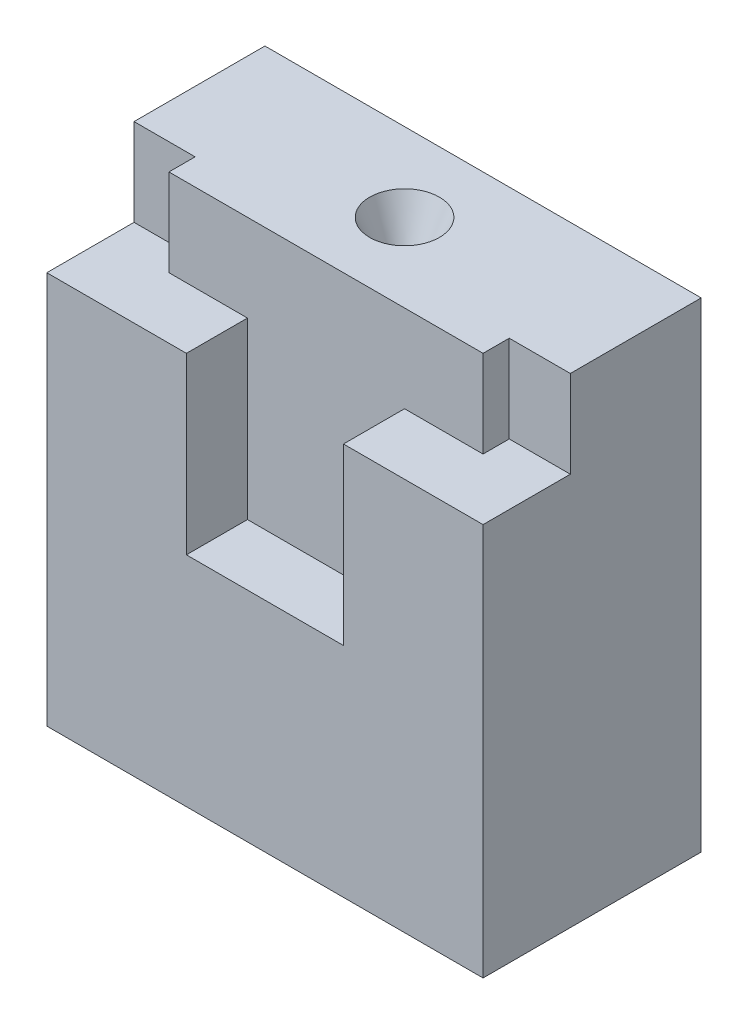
from build123d import *

# Parameters (mm, degrees)
SKETCH_1_W          = 50
SKETCH_1_H          = 25
EXTRUDE_1_DEPTH     = 55
SKETCH_3_W          = 18
SKETCH_3_H          = 7
CUT_EXTRUDE_2_DEPTH = 30
CUT_EXTRUDE_3_DEPTH = 10


with BuildPart() as part:
    # Sketch 1 → Extrude 1 (new body)
    with BuildSketch(Plane(origin=(0, 0, 0), x_dir=(1, 0, 0), z_dir=(0, 1, 0))):
        Rectangle(SKETCH_1_W, SKETCH_1_H)
    extrude(amount=EXTRUDE_1_DEPTH)

    # Sketch 3 → Cut-Extrude 2 (cut)
    with BuildSketch(Plane(origin=(0, 55, 0), x_dir=(1, 0, 0), z_dir=(0, 1, 0))):
        with Locations((0, -9)):
            Rectangle(SKETCH_3_W, SKETCH_3_H)
    extrude(amount=-CUT_EXTRUDE_2_DEPTH, mode=Mode.SUBTRACT)

    # Sketch 4 → Cut-Extrude 3 (cut)
    with BuildSketch(Plane(origin=(0, 55, 0), x_dir=(1, 0, 0), z_dir=(0, 1, 0))):
        Polygon((-9, -5.5), (-18, -5.5), (-18, -2.5), (-25, -2.5), (-25, -12.5), (-9, -12.5), align=None)
        Polygon((9, -12.5), (9, -5.5), (18, -5.5), (18, -2.5), (25, -2.5), (25, -12.5), align=None)
    extrude(amount=-CUT_EXTRUDE_3_DEPTH, mode=Mode.SUBTRACT)

    # Sketch 5 → Cut-Revolve 1 (revolve, cut)
    with BuildSketch(Plane(origin=(0, 0, 0), x_dir=(0, 0, -1), z_dir=(1, 0, 0))):
        Polygon((3.5, 55), (-0.5, 55), (3.5, 45.559401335), align=None)
    revolve(axis=Axis((0, 4.092667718, -3.5), (0, 1, 0)), mode=Mode.SUBTRACT)


solid = part.part
